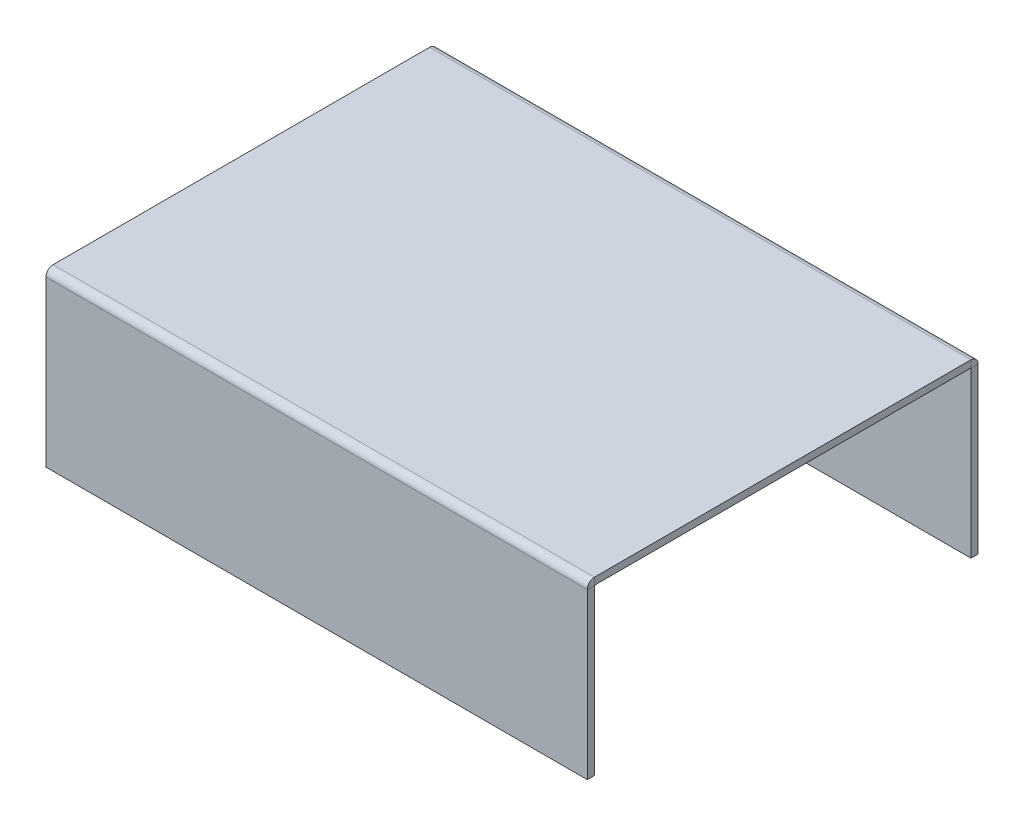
ISO-10303-21;
HEADER;
FILE_DESCRIPTION(('STEP AP214'),'2;1');
FILE_NAME('part.step','',(''),(''),'','','');
FILE_SCHEMA(('AUTOMOTIVE_DESIGN { 1 0 10303 214 1 1 1 1 }'));
ENDSEC;
DATA;
#1=APPLICATION_CONTEXT('core data for automotive mechanical design processes');
#2=APPLICATION_PROTOCOL_DEFINITION('international standard','automotive_design',2000,#1);
#3=PRODUCT_CONTEXT('',#1,'mechanical');
#4=PRODUCT('Part','Part','',(#3));
#5=PRODUCT_RELATED_PRODUCT_CATEGORY('part','',(#4));
#6=PRODUCT_DEFINITION_FORMATION('','',#4);
#7=PRODUCT_DEFINITION_CONTEXT('part definition',#1,'design');
#8=PRODUCT_DEFINITION('design','',#6,#7);
#9=PRODUCT_DEFINITION_SHAPE('','',#8);
#10=(LENGTH_UNIT() NAMED_UNIT(*) SI_UNIT(.MILLI.,.METRE.));
#11=(NAMED_UNIT(*) PLANE_ANGLE_UNIT() SI_UNIT($,.RADIAN.));
#12=(NAMED_UNIT(*) SI_UNIT($,.STERADIAN.) SOLID_ANGLE_UNIT());
#13=UNCERTAINTY_MEASURE_WITH_UNIT(LENGTH_MEASURE(1.E-05),#10,'distance_accuracy_value','');
#14=(GEOMETRIC_REPRESENTATION_CONTEXT(3) GLOBAL_UNCERTAINTY_ASSIGNED_CONTEXT((#13)) GLOBAL_UNIT_ASSIGNED_CONTEXT((#10,
#11,#12)) REPRESENTATION_CONTEXT('',''));
#15=CARTESIAN_POINT('',(0.,0.,0.));
#16=DIRECTION('',(0.,0.,1.));
#17=DIRECTION('',(1.,0.,0.));
#18=AXIS2_PLACEMENT_3D('',#15,#16,#17);
#19=CARTESIAN_POINT('',(0.,1.5,-150.));
#20=DIRECTION('',(0.,-1.,0.));
#21=DIRECTION('',(0.,0.,-1.));
#22=AXIS2_PLACEMENT_3D('',#19,#20,#21);
#23=PLANE('',#22);
#24=DIRECTION('',(0.,0.,1.));
#25=VECTOR('',#24,1.);
#26=CARTESIAN_POINT('',(0.,1.5,0.));
#27=LINE('',#26,#25);
#28=CARTESIAN_POINT('',(0.,1.5,-114.992134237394));
#29=VERTEX_POINT('',#28);
#30=CARTESIAN_POINT('',(0.,1.5,-35.0078657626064));
#31=VERTEX_POINT('',#30);
#32=EDGE_CURVE('E45',#29,#31,#27,.T.);
#33=ORIENTED_EDGE('',*,*,#32,.T.);
#34=DIRECTION('',(1.,0.,0.));
#35=VECTOR('',#34,1.);
#36=CARTESIAN_POINT('',(0.,1.5,-35.0078657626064));
#37=LINE('',#36,#35);
#38=CARTESIAN_POINT('',(115.,1.5,-35.0078657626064));
#39=VERTEX_POINT('',#38);
#40=EDGE_CURVE('E236',#31,#39,#37,.T.);
#41=ORIENTED_EDGE('',*,*,#40,.T.);
#42=DIRECTION('',(0.,0.,-1.));
#43=VECTOR('',#42,1.);
#44=CARTESIAN_POINT('',(115.,1.5,0.));
#45=LINE('',#44,#43);
#46=CARTESIAN_POINT('',(115.,1.5,-114.992134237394));
#47=VERTEX_POINT('',#46);
#48=EDGE_CURVE('E228',#39,#47,#45,.T.);
#49=ORIENTED_EDGE('',*,*,#48,.T.);
#50=DIRECTION('',(1.,0.,0.));
#51=VECTOR('',#50,1.);
#52=CARTESIAN_POINT('',(0.,1.5,-114.992134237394));
#53=LINE('',#52,#51);
#54=EDGE_CURVE('E224',#29,#47,#53,.T.);
#55=ORIENTED_EDGE('',*,*,#54,.F.);
#56=EDGE_LOOP('',(#33,#41,#49,#55));
#57=FACE_BOUND('',#56,.T.);
#58=ADVANCED_FACE('F41',(#57),#23,.F.);
#59=CARTESIAN_POINT('',(115.,1.5,0.));
#60=DIRECTION('',(-1.,0.,0.));
#61=DIRECTION('',(0.,0.,1.));
#62=AXIS2_PLACEMENT_3D('',#59,#60,#61);
#63=PLANE('',#62);
#64=ORIENTED_EDGE('',*,*,#48,.F.);
#65=DIRECTION('',(0.,-1.,0.));
#66=VECTOR('',#65,1.);
#67=CARTESIAN_POINT('',(115.,1.5,-35.0078657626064));
#68=LINE('',#67,#66);
#69=CARTESIAN_POINT('',(115.,0.,-35.0078657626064));
#70=VERTEX_POINT('',#69);
#71=EDGE_CURVE('E12',#39,#70,#68,.T.);
#72=ORIENTED_EDGE('',*,*,#71,.T.);
#73=DIRECTION('',(0.,0.,-1.));
#74=VECTOR('',#73,1.);
#75=CARTESIAN_POINT('',(115.,0.,0.));
#76=LINE('',#75,#74);
#77=CARTESIAN_POINT('',(115.,0.,-114.992134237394));
#78=VERTEX_POINT('',#77);
#79=EDGE_CURVE('E243',#70,#78,#76,.T.);
#80=ORIENTED_EDGE('',*,*,#79,.T.);
#81=DIRECTION('',(0.,-1.,0.));
#82=VECTOR('',#81,1.);
#83=CARTESIAN_POINT('',(115.,1.49999999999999,-114.992134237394));
#84=LINE('',#83,#82);
#85=EDGE_CURVE('E227',#47,#78,#84,.T.);
#86=ORIENTED_EDGE('',*,*,#85,.F.);
#87=EDGE_LOOP('',(#64,#72,#80,#86));
#88=FACE_BOUND('',#87,.T.);
#89=ADVANCED_FACE('F43',(#88),#63,.F.);
#90=CARTESIAN_POINT('',(0.,1.5,0.));
#91=DIRECTION('',(1.,0.,0.));
#92=DIRECTION('',(0.,0.,-1.));
#93=AXIS2_PLACEMENT_3D('',#90,#91,#92);
#94=PLANE('',#93);
#95=DIRECTION('',(0.,0.,1.));
#96=VECTOR('',#95,1.);
#97=CARTESIAN_POINT('',(0.,0.,0.));
#98=LINE('',#97,#96);
#99=CARTESIAN_POINT('',(0.,0.,-114.992134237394));
#100=VERTEX_POINT('',#99);
#101=CARTESIAN_POINT('',(0.,0.,-35.0078657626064));
#102=VERTEX_POINT('',#101);
#103=EDGE_CURVE('E64',#100,#102,#98,.T.);
#104=ORIENTED_EDGE('',*,*,#103,.T.);
#105=DIRECTION('',(0.,1.,0.));
#106=VECTOR('',#105,1.);
#107=CARTESIAN_POINT('',(0.,1.5,-35.0078657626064));
#108=LINE('',#107,#106);
#109=EDGE_CURVE('E239',#102,#31,#108,.T.);
#110=ORIENTED_EDGE('',*,*,#109,.T.);
#111=ORIENTED_EDGE('',*,*,#32,.F.);
#112=DIRECTION('',(0.,1.,0.));
#113=VECTOR('',#112,1.);
#114=CARTESIAN_POINT('',(0.,1.49999999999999,-114.992134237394));
#115=LINE('',#114,#113);
#116=EDGE_CURVE('E233',#100,#29,#115,.T.);
#117=ORIENTED_EDGE('',*,*,#116,.F.);
#118=EDGE_LOOP('',(#104,#110,#111,#117));
#119=FACE_BOUND('',#118,.T.);
#120=ADVANCED_FACE('F252',(#119),#94,.F.);
#121=CARTESIAN_POINT('',(0.,0.,-150.));
#122=DIRECTION('',(0.,-1.,0.));
#123=DIRECTION('',(0.,0.,-1.));
#124=AXIS2_PLACEMENT_3D('',#121,#122,#123);
#125=PLANE('',#124);
#126=DIRECTION('',(1.,0.,0.));
#127=VECTOR('',#126,1.);
#128=CARTESIAN_POINT('',(0.,0.,-35.0078657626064));
#129=LINE('',#128,#127);
#130=EDGE_CURVE('E50',#102,#70,#129,.T.);
#131=ORIENTED_EDGE('',*,*,#130,.F.);
#132=ORIENTED_EDGE('',*,*,#103,.F.);
#133=DIRECTION('',(1.,0.,0.));
#134=VECTOR('',#133,1.);
#135=CARTESIAN_POINT('',(0.,0.,-114.992134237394));
#136=LINE('',#135,#134);
#137=EDGE_CURVE('E231',#100,#78,#136,.T.);
#138=ORIENTED_EDGE('',*,*,#137,.T.);
#139=ORIENTED_EDGE('',*,*,#79,.F.);
#140=EDGE_LOOP('',(#131,#132,#138,#139));
#141=FACE_BOUND('',#140,.T.);
#142=ADVANCED_FACE('F293',(#141),#125,.T.);
#143=CARTESIAN_POINT('',(0.,-0.01,-114.992134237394));
#144=DIRECTION('',(-1.,0.,0.));
#145=DIRECTION('',(0.,0.,1.));
#146=AXIS2_PLACEMENT_3D('',#143,#144,#145);
#147=PLANE('',#146);
#148=DIRECTION('',(0.,0.,-1.));
#149=VECTOR('',#148,1.);
#150=CARTESIAN_POINT('',(0.,-0.01000000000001,-116.502134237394));
#151=LINE('',#150,#149);
#152=CARTESIAN_POINT('',(0.,-0.01000000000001,-115.002134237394));
#153=VERTEX_POINT('',#152);
#154=CARTESIAN_POINT('',(0.,-0.01000000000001,-116.502134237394));
#155=VERTEX_POINT('',#154);
#156=EDGE_CURVE('E187',#153,#155,#151,.T.);
#157=ORIENTED_EDGE('',*,*,#156,.F.);
#158=CARTESIAN_POINT('',(0.,-0.01,-114.992134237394));
#159=DIRECTION('',(-1.,0.,0.));
#160=DIRECTION('',(0.,0.,1.));
#161=AXIS2_PLACEMENT_3D('',#158,#159,#160);
#162=CIRCLE('',#161,0.01);
#163=EDGE_CURVE('E186',#153,#100,#162,.F.);
#164=ORIENTED_EDGE('',*,*,#163,.T.);
#165=ORIENTED_EDGE('',*,*,#116,.T.);
#166=CARTESIAN_POINT('',(0.,-0.01,-114.992134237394));
#167=DIRECTION('',(1.,0.,0.));
#168=DIRECTION('',(0.,0.,-1.));
#169=AXIS2_PLACEMENT_3D('',#166,#167,#168);
#170=CIRCLE('',#169,1.51);
#171=EDGE_CURVE('E213',#155,#29,#170,.T.);
#172=ORIENTED_EDGE('',*,*,#171,.F.);
#173=EDGE_LOOP('',(#157,#164,#165,#172));
#174=FACE_BOUND('',#173,.T.);
#175=ADVANCED_FACE('F290',(#174),#147,.T.);
#176=CARTESIAN_POINT('',(115.,-0.01,-114.992134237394));
#177=DIRECTION('',(1.,0.,0.));
#178=DIRECTION('',(0.,0.,-1.));
#179=AXIS2_PLACEMENT_3D('',#176,#177,#178);
#180=PLANE('',#179);
#181=ORIENTED_EDGE('',*,*,#85,.T.);
#182=CARTESIAN_POINT('',(115.,-0.01,-114.992134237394));
#183=DIRECTION('',(-1.,0.,0.));
#184=DIRECTION('',(0.,0.,1.));
#185=AXIS2_PLACEMENT_3D('',#182,#183,#184);
#186=CIRCLE('',#185,0.01);
#187=CARTESIAN_POINT('',(115.,-0.01000000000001,-115.002134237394));
#188=VERTEX_POINT('',#187);
#189=EDGE_CURVE('E217',#78,#188,#186,.T.);
#190=ORIENTED_EDGE('',*,*,#189,.T.);
#191=DIRECTION('',(0.,0.,1.));
#192=VECTOR('',#191,1.);
#193=CARTESIAN_POINT('',(115.,-0.01000000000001,-116.502134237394));
#194=LINE('',#193,#192);
#195=CARTESIAN_POINT('',(115.,-0.0100000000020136,-116.502134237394));
#196=VERTEX_POINT('',#195);
#197=EDGE_CURVE('E194',#196,#188,#194,.T.);
#198=ORIENTED_EDGE('',*,*,#197,.F.);
#199=CARTESIAN_POINT('',(115.,-0.01,-114.992134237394));
#200=DIRECTION('',(-1.,0.,0.));
#201=DIRECTION('',(0.,0.,1.));
#202=AXIS2_PLACEMENT_3D('',#199,#200,#201);
#203=CIRCLE('',#202,1.51);
#204=EDGE_CURVE('E216',#47,#196,#203,.T.);
#205=ORIENTED_EDGE('',*,*,#204,.F.);
#206=EDGE_LOOP('',(#181,#190,#198,#205));
#207=FACE_BOUND('',#206,.T.);
#208=ADVANCED_FACE('F298',(#207),#180,.T.);
#209=CARTESIAN_POINT('',(172.509783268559,-0.01,-114.992134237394));
#210=DIRECTION('',(-1.,0.,0.));
#211=DIRECTION('',(0.,0.,1.));
#212=AXIS2_PLACEMENT_3D('',#209,#210,#211);
#213=CYLINDRICAL_SURFACE('',#212,1.51);
#214=ORIENTED_EDGE('',*,*,#204,.T.);
#215=DIRECTION('',(1.,0.,0.));
#216=VECTOR('',#215,1.);
#217=CARTESIAN_POINT('',(0.,-0.01000000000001,-116.502134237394));
#218=LINE('',#217,#216);
#219=EDGE_CURVE('E201',#155,#196,#218,.T.);
#220=ORIENTED_EDGE('',*,*,#219,.F.);
#221=ORIENTED_EDGE('',*,*,#171,.T.);
#222=ORIENTED_EDGE('',*,*,#54,.T.);
#223=EDGE_LOOP('',(#214,#220,#221,#222));
#224=FACE_BOUND('',#223,.T.);
#225=ADVANCED_FACE('F305',(#224),#213,.T.);
#226=CARTESIAN_POINT('',(172.509783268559,-0.01,-114.992134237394));
#227=DIRECTION('',(-1.,0.,0.));
#228=DIRECTION('',(0.,0.,1.));
#229=AXIS2_PLACEMENT_3D('',#226,#227,#228);
#230=CYLINDRICAL_SURFACE('',#229,0.01);
#231=ORIENTED_EDGE('',*,*,#189,.F.);
#232=ORIENTED_EDGE('',*,*,#137,.F.);
#233=ORIENTED_EDGE('',*,*,#163,.F.);
#234=DIRECTION('',(1.,0.,0.));
#235=VECTOR('',#234,1.);
#236=CARTESIAN_POINT('',(0.,-0.01000000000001,-115.002134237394));
#237=LINE('',#236,#235);
#238=EDGE_CURVE('E178',#153,#188,#237,.T.);
#239=ORIENTED_EDGE('',*,*,#238,.T.);
#240=EDGE_LOOP('',(#231,#232,#233,#239));
#241=FACE_BOUND('',#240,.T.);
#242=ADVANCED_FACE('F324',(#241),#230,.F.);
#243=CARTESIAN_POINT('',(0.,-35.0021342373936,-116.502134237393));
#244=DIRECTION('',(0.,1.,0.));
#245=DIRECTION('',(1.,0.,0.));
#246=AXIS2_PLACEMENT_3D('',#243,#244,#245);
#247=PLANE('',#246);
#248=DIRECTION('',(-1.,0.,0.));
#249=VECTOR('',#248,1.);
#250=CARTESIAN_POINT('',(0.,-35.0021342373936,-115.002134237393));
#251=LINE('',#250,#249);
#252=CARTESIAN_POINT('',(115.,-35.0021342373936,-115.002134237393));
#253=VERTEX_POINT('',#252);
#254=CARTESIAN_POINT('',(0.,-35.0021342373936,-115.002134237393));
#255=VERTEX_POINT('',#254);
#256=EDGE_CURVE('E209',#253,#255,#251,.T.);
#257=ORIENTED_EDGE('',*,*,#256,.T.);
#258=DIRECTION('',(0.,0.,1.));
#259=VECTOR('',#258,1.);
#260=CARTESIAN_POINT('',(0.,-35.0021342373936,-116.502134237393));
#261=LINE('',#260,#259);
#262=CARTESIAN_POINT('',(0.,-35.0021342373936,-116.502134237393));
#263=VERTEX_POINT('',#262);
#264=EDGE_CURVE('E183',#263,#255,#261,.T.);
#265=ORIENTED_EDGE('',*,*,#264,.F.);
#266=DIRECTION('',(-1.,0.,0.));
#267=VECTOR('',#266,1.);
#268=CARTESIAN_POINT('',(0.,-35.0021342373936,-116.502134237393));
#269=LINE('',#268,#267);
#270=CARTESIAN_POINT('',(115.,-35.0021342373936,-116.502134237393));
#271=VERTEX_POINT('',#270);
#272=EDGE_CURVE('E197',#271,#263,#269,.T.);
#273=ORIENTED_EDGE('',*,*,#272,.F.);
#274=DIRECTION('',(0.,0.,1.));
#275=VECTOR('',#274,1.);
#276=CARTESIAN_POINT('',(115.,-35.0021342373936,-116.502134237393));
#277=LINE('',#276,#275);
#278=EDGE_CURVE('E206',#271,#253,#277,.T.);
#279=ORIENTED_EDGE('',*,*,#278,.T.);
#280=EDGE_LOOP('',(#257,#265,#273,#279));
#281=FACE_BOUND('',#280,.T.);
#282=ADVANCED_FACE('F329',(#281),#247,.F.);
#283=CARTESIAN_POINT('',(0.,-35.0021342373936,-116.502134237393));
#284=DIRECTION('',(0.,0.,1.));
#285=DIRECTION('',(0.,-1.,0.));
#286=AXIS2_PLACEMENT_3D('',#283,#284,#285);
#287=PLANE('',#286);
#288=DIRECTION('',(0.,1.,0.));
#289=VECTOR('',#288,1.);
#290=CARTESIAN_POINT('',(0.,114.997865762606,-116.502134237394));
#291=LINE('',#290,#289);
#292=EDGE_CURVE('E204',#263,#155,#291,.T.);
#293=ORIENTED_EDGE('',*,*,#292,.T.);
#294=ORIENTED_EDGE('',*,*,#219,.T.);
#295=DIRECTION('',(0.,-1.,0.));
#296=VECTOR('',#295,1.);
#297=CARTESIAN_POINT('',(115.,114.997865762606,-116.502134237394));
#298=LINE('',#297,#296);
#299=EDGE_CURVE('E199',#196,#271,#298,.T.);
#300=ORIENTED_EDGE('',*,*,#299,.T.);
#301=ORIENTED_EDGE('',*,*,#272,.T.);
#302=EDGE_LOOP('',(#293,#294,#300,#301));
#303=FACE_BOUND('',#302,.T.);
#304=ADVANCED_FACE('F314',(#303),#287,.F.);
#305=CARTESIAN_POINT('',(115.,114.997865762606,-116.502134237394));
#306=DIRECTION('',(-1.,0.,0.));
#307=DIRECTION('',(0.,1.,0.));
#308=AXIS2_PLACEMENT_3D('',#305,#306,#307);
#309=PLANE('',#308);
#310=ORIENTED_EDGE('',*,*,#299,.F.);
#311=ORIENTED_EDGE('',*,*,#197,.T.);
#312=DIRECTION('',(0.,-1.,0.));
#313=VECTOR('',#312,1.);
#314=CARTESIAN_POINT('',(115.,114.997865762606,-115.002134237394));
#315=LINE('',#314,#313);
#316=EDGE_CURVE('E192',#188,#253,#315,.T.);
#317=ORIENTED_EDGE('',*,*,#316,.T.);
#318=ORIENTED_EDGE('',*,*,#278,.F.);
#319=EDGE_LOOP('',(#310,#311,#317,#318));
#320=FACE_BOUND('',#319,.T.);
#321=ADVANCED_FACE('F310',(#320),#309,.F.);
#322=CARTESIAN_POINT('',(0.,-35.0021342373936,-115.002134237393));
#323=DIRECTION('',(0.,0.,1.));
#324=DIRECTION('',(0.,-1.,0.));
#325=AXIS2_PLACEMENT_3D('',#322,#323,#324);
#326=PLANE('',#325);
#327=ORIENTED_EDGE('',*,*,#238,.F.);
#328=DIRECTION('',(0.,1.,0.));
#329=VECTOR('',#328,1.);
#330=CARTESIAN_POINT('',(0.,114.997865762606,-115.002134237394));
#331=LINE('',#330,#329);
#332=EDGE_CURVE('E190',#255,#153,#331,.T.);
#333=ORIENTED_EDGE('',*,*,#332,.F.);
#334=ORIENTED_EDGE('',*,*,#256,.F.);
#335=ORIENTED_EDGE('',*,*,#316,.F.);
#336=EDGE_LOOP('',(#327,#333,#334,#335));
#337=FACE_BOUND('',#336,.T.);
#338=ADVANCED_FACE('F326',(#337),#326,.T.);
#339=CARTESIAN_POINT('',(0.,114.997865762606,-116.502134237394));
#340=DIRECTION('',(1.,0.,0.));
#341=DIRECTION('',(0.,-1.,0.));
#342=AXIS2_PLACEMENT_3D('',#339,#340,#341);
#343=PLANE('',#342);
#344=ORIENTED_EDGE('',*,*,#332,.T.);
#345=ORIENTED_EDGE('',*,*,#156,.T.);
#346=ORIENTED_EDGE('',*,*,#292,.F.);
#347=ORIENTED_EDGE('',*,*,#264,.T.);
#348=EDGE_LOOP('',(#344,#345,#346,#347));
#349=FACE_BOUND('',#348,.T.);
#350=ADVANCED_FACE('F319',(#349),#343,.F.);
#351=CARTESIAN_POINT('',(0.,-0.01,-35.0078657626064));
#352=DIRECTION('',(-1.,0.,0.));
#353=DIRECTION('',(0.,0.,1.));
#354=AXIS2_PLACEMENT_3D('',#351,#352,#353);
#355=PLANE('',#354);
#356=ORIENTED_EDGE('',*,*,#109,.F.);
#357=CARTESIAN_POINT('',(0.,-0.01,-35.0078657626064));
#358=DIRECTION('',(1.,0.,0.));
#359=DIRECTION('',(0.,0.,-1.));
#360=AXIS2_PLACEMENT_3D('',#357,#358,#359);
#361=CIRCLE('',#360,0.01);
#362=CARTESIAN_POINT('',(0.,-0.0100000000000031,-34.9978657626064));
#363=VERTEX_POINT('',#362);
#364=EDGE_CURVE('E180',#102,#363,#361,.T.);
#365=ORIENTED_EDGE('',*,*,#364,.T.);
#366=DIRECTION('',(0.,0.,1.));
#367=VECTOR('',#366,1.);
#368=CARTESIAN_POINT('',(0.,-0.01000000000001,-33.4978657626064));
#369=LINE('',#368,#367);
#370=CARTESIAN_POINT('',(0.,-0.0100000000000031,-33.4978657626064));
#371=VERTEX_POINT('',#370);
#372=EDGE_CURVE('E141',#363,#371,#369,.T.);
#373=ORIENTED_EDGE('',*,*,#372,.T.);
#374=CARTESIAN_POINT('',(0.,-0.01,-35.0078657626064));
#375=DIRECTION('',(1.,0.,0.));
#376=DIRECTION('',(0.,0.,-1.));
#377=AXIS2_PLACEMENT_3D('',#374,#375,#376);
#378=CIRCLE('',#377,1.51);
#379=EDGE_CURVE('E171',#31,#371,#378,.T.);
#380=ORIENTED_EDGE('',*,*,#379,.F.);
#381=EDGE_LOOP('',(#356,#365,#373,#380));
#382=FACE_BOUND('',#381,.T.);
#383=ADVANCED_FACE('F254',(#382),#355,.T.);
#384=CARTESIAN_POINT('',(115.,-0.01,-35.0078657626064));
#385=DIRECTION('',(1.,0.,0.));
#386=DIRECTION('',(0.,0.,-1.));
#387=AXIS2_PLACEMENT_3D('',#384,#385,#386);
#388=PLANE('',#387);
#389=DIRECTION('',(0.,0.,-1.));
#390=VECTOR('',#389,1.);
#391=CARTESIAN_POINT('',(115.,-0.01000000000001,-33.4978657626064));
#392=LINE('',#391,#390);
#393=CARTESIAN_POINT('',(115.,-0.00999999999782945,-33.4978657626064));
#394=VERTEX_POINT('',#393);
#395=CARTESIAN_POINT('',(115.,-0.0100000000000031,-34.9978657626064));
#396=VERTEX_POINT('',#395);
#397=EDGE_CURVE('E165',#394,#396,#392,.T.);
#398=ORIENTED_EDGE('',*,*,#397,.T.);
#399=CARTESIAN_POINT('',(115.,-0.01,-35.0078657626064));
#400=DIRECTION('',(1.,0.,0.));
#401=DIRECTION('',(0.,0.,-1.));
#402=AXIS2_PLACEMENT_3D('',#399,#400,#401);
#403=CIRCLE('',#402,0.01);
#404=EDGE_CURVE('E175',#396,#70,#403,.F.);
#405=ORIENTED_EDGE('',*,*,#404,.T.);
#406=ORIENTED_EDGE('',*,*,#71,.F.);
#407=CARTESIAN_POINT('',(115.,-0.01,-35.0078657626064));
#408=DIRECTION('',(-1.,0.,0.));
#409=DIRECTION('',(0.,0.,1.));
#410=AXIS2_PLACEMENT_3D('',#407,#408,#409);
#411=CIRCLE('',#410,1.51);
#412=EDGE_CURVE('E174',#394,#39,#411,.T.);
#413=ORIENTED_EDGE('',*,*,#412,.F.);
#414=EDGE_LOOP('',(#398,#405,#406,#413));
#415=FACE_BOUND('',#414,.T.);
#416=ADVANCED_FACE('F269',(#415),#388,.T.);
#417=CARTESIAN_POINT('',(-57.5097832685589,-0.01,-35.0078657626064));
#418=DIRECTION('',(1.,0.,0.));
#419=DIRECTION('',(0.,0.,-1.));
#420=AXIS2_PLACEMENT_3D('',#417,#418,#419);
#421=CYLINDRICAL_SURFACE('',#420,1.51);
#422=ORIENTED_EDGE('',*,*,#412,.T.);
#423=ORIENTED_EDGE('',*,*,#40,.F.);
#424=ORIENTED_EDGE('',*,*,#379,.T.);
#425=DIRECTION('',(1.,0.,0.));
#426=VECTOR('',#425,1.);
#427=CARTESIAN_POINT('',(0.,-0.0100000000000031,-33.4978657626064));
#428=LINE('',#427,#426);
#429=EDGE_CURVE('E168',#371,#394,#428,.T.);
#430=ORIENTED_EDGE('',*,*,#429,.T.);
#431=EDGE_LOOP('',(#422,#423,#424,#430));
#432=FACE_BOUND('',#431,.T.);
#433=ADVANCED_FACE('F272',(#432),#421,.T.);
#434=CARTESIAN_POINT('',(-57.5097832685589,-0.01,-35.0078657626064));
#435=DIRECTION('',(1.,0.,0.));
#436=DIRECTION('',(0.,0.,-1.));
#437=AXIS2_PLACEMENT_3D('',#434,#435,#436);
#438=CYLINDRICAL_SURFACE('',#437,0.01);
#439=ORIENTED_EDGE('',*,*,#404,.F.);
#440=DIRECTION('',(1.,0.,0.));
#441=VECTOR('',#440,1.);
#442=CARTESIAN_POINT('',(0.,-0.00999999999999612,-34.9978657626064));
#443=LINE('',#442,#441);
#444=EDGE_CURVE('E145',#363,#396,#443,.T.);
#445=ORIENTED_EDGE('',*,*,#444,.F.);
#446=ORIENTED_EDGE('',*,*,#364,.F.);
#447=ORIENTED_EDGE('',*,*,#130,.T.);
#448=EDGE_LOOP('',(#439,#445,#446,#447));
#449=FACE_BOUND('',#448,.T.);
#450=ADVANCED_FACE('F255',(#449),#438,.F.);
#451=CARTESIAN_POINT('',(0.,-35.0021342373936,-33.4978657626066));
#452=DIRECTION('',(0.,1.,0.));
#453=DIRECTION('',(-1.,0.,0.));
#454=AXIS2_PLACEMENT_3D('',#451,#452,#453);
#455=PLANE('',#454);
#456=DIRECTION('',(1.,0.,0.));
#457=VECTOR('',#456,1.);
#458=CARTESIAN_POINT('',(0.,-35.0021342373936,-34.9978657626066));
#459=LINE('',#458,#457);
#460=CARTESIAN_POINT('',(0.,-35.0021342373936,-34.9978657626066));
#461=VERTEX_POINT('',#460);
#462=CARTESIAN_POINT('',(115.,-35.0021342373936,-34.9978657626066));
#463=VERTEX_POINT('',#462);
#464=EDGE_CURVE('E149',#461,#463,#459,.T.);
#465=ORIENTED_EDGE('',*,*,#464,.T.);
#466=DIRECTION('',(0.,0.,-1.));
#467=VECTOR('',#466,1.);
#468=CARTESIAN_POINT('',(115.,-35.0021342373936,-33.4978657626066));
#469=LINE('',#468,#467);
#470=CARTESIAN_POINT('',(115.,-35.0021342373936,-33.4978657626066));
#471=VERTEX_POINT('',#470);
#472=EDGE_CURVE('E256',#471,#463,#469,.T.);
#473=ORIENTED_EDGE('',*,*,#472,.F.);
#474=DIRECTION('',(1.,0.,0.));
#475=VECTOR('',#474,1.);
#476=CARTESIAN_POINT('',(0.,-35.0021342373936,-33.4978657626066));
#477=LINE('',#476,#475);
#478=CARTESIAN_POINT('',(0.,-35.0021342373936,-33.4978657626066));
#479=VERTEX_POINT('',#478);
#480=EDGE_CURVE('E158',#479,#471,#477,.T.);
#481=ORIENTED_EDGE('',*,*,#480,.F.);
#482=DIRECTION('',(0.,0.,-1.));
#483=VECTOR('',#482,1.);
#484=CARTESIAN_POINT('',(0.,-35.0021342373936,-33.4978657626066));
#485=LINE('',#484,#483);
#486=EDGE_CURVE('E139',#479,#461,#485,.T.);
#487=ORIENTED_EDGE('',*,*,#486,.T.);
#488=EDGE_LOOP('',(#465,#473,#481,#487));
#489=FACE_BOUND('',#488,.T.);
#490=ADVANCED_FACE('F157',(#489),#455,.F.);
#491=CARTESIAN_POINT('',(0.,114.997865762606,-33.497865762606));
#492=DIRECTION('',(0.,0.,-1.));
#493=DIRECTION('',(0.,1.,0.));
#494=AXIS2_PLACEMENT_3D('',#491,#492,#493);
#495=PLANE('',#494);
#496=ORIENTED_EDGE('',*,*,#429,.F.);
#497=DIRECTION('',(0.,-1.,0.));
#498=VECTOR('',#497,1.);
#499=CARTESIAN_POINT('',(0.,-35.0021342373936,-33.4978657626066));
#500=LINE('',#499,#498);
#501=EDGE_CURVE('E159',#371,#479,#500,.T.);
#502=ORIENTED_EDGE('',*,*,#501,.T.);
#503=ORIENTED_EDGE('',*,*,#480,.T.);
#504=DIRECTION('',(0.,1.,0.));
#505=VECTOR('',#504,1.);
#506=CARTESIAN_POINT('',(115.,-35.0021342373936,-33.4978657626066));
#507=LINE('',#506,#505);
#508=EDGE_CURVE('E146',#471,#394,#507,.T.);
#509=ORIENTED_EDGE('',*,*,#508,.T.);
#510=EDGE_LOOP('',(#496,#502,#503,#509));
#511=FACE_BOUND('',#510,.T.);
#512=ADVANCED_FACE('F263',(#511),#495,.F.);
#513=CARTESIAN_POINT('',(0.,-35.0021342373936,-33.4978657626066));
#514=DIRECTION('',(1.,0.,0.));
#515=DIRECTION('',(0.,1.,0.));
#516=AXIS2_PLACEMENT_3D('',#513,#514,#515);
#517=PLANE('',#516);
#518=ORIENTED_EDGE('',*,*,#372,.F.);
#519=DIRECTION('',(0.,-1.,0.));
#520=VECTOR('',#519,1.);
#521=CARTESIAN_POINT('',(0.,-35.0021342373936,-34.9978657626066));
#522=LINE('',#521,#520);
#523=EDGE_CURVE('E134',#363,#461,#522,.T.);
#524=ORIENTED_EDGE('',*,*,#523,.T.);
#525=ORIENTED_EDGE('',*,*,#486,.F.);
#526=ORIENTED_EDGE('',*,*,#501,.F.);
#527=EDGE_LOOP('',(#518,#524,#525,#526));
#528=FACE_BOUND('',#527,.T.);
#529=ADVANCED_FACE('F136',(#528),#517,.F.);
#530=CARTESIAN_POINT('',(0.,114.997865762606,-34.997865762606));
#531=DIRECTION('',(0.,0.,-1.));
#532=DIRECTION('',(0.,1.,0.));
#533=AXIS2_PLACEMENT_3D('',#530,#531,#532);
#534=PLANE('',#533);
#535=ORIENTED_EDGE('',*,*,#523,.F.);
#536=ORIENTED_EDGE('',*,*,#444,.T.);
#537=DIRECTION('',(0.,1.,0.));
#538=VECTOR('',#537,1.);
#539=CARTESIAN_POINT('',(115.,-35.0021342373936,-34.9978657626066));
#540=LINE('',#539,#538);
#541=EDGE_CURVE('E151',#463,#396,#540,.T.);
#542=ORIENTED_EDGE('',*,*,#541,.F.);
#543=ORIENTED_EDGE('',*,*,#464,.F.);
#544=EDGE_LOOP('',(#535,#536,#542,#543));
#545=FACE_BOUND('',#544,.T.);
#546=ADVANCED_FACE('F150',(#545),#534,.T.);
#547=CARTESIAN_POINT('',(115.,-35.0021342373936,-33.4978657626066));
#548=DIRECTION('',(-1.,0.,0.));
#549=DIRECTION('',(0.,-1.,0.));
#550=AXIS2_PLACEMENT_3D('',#547,#548,#549);
#551=PLANE('',#550);
#552=ORIENTED_EDGE('',*,*,#397,.F.);
#553=ORIENTED_EDGE('',*,*,#508,.F.);
#554=ORIENTED_EDGE('',*,*,#472,.T.);
#555=ORIENTED_EDGE('',*,*,#541,.T.);
#556=EDGE_LOOP('',(#552,#553,#554,#555));
#557=FACE_BOUND('',#556,.T.);
#558=ADVANCED_FACE('F266',(#557),#551,.F.);
#559=CLOSED_SHELL('',(#58,#89,#120,#142,#175,#208,#225,#242,#282,#304,#321,#338,#350,#383,#416,
#433,#450,#490,#512,#529,#546,#558));
#560=MANIFOLD_SOLID_BREP('B2',#559);
#561=ADVANCED_BREP_SHAPE_REPRESENTATION('',(#18,#560),#14);
#562=SHAPE_DEFINITION_REPRESENTATION(#9,#561);
ENDSEC;
END-ISO-10303-21;
